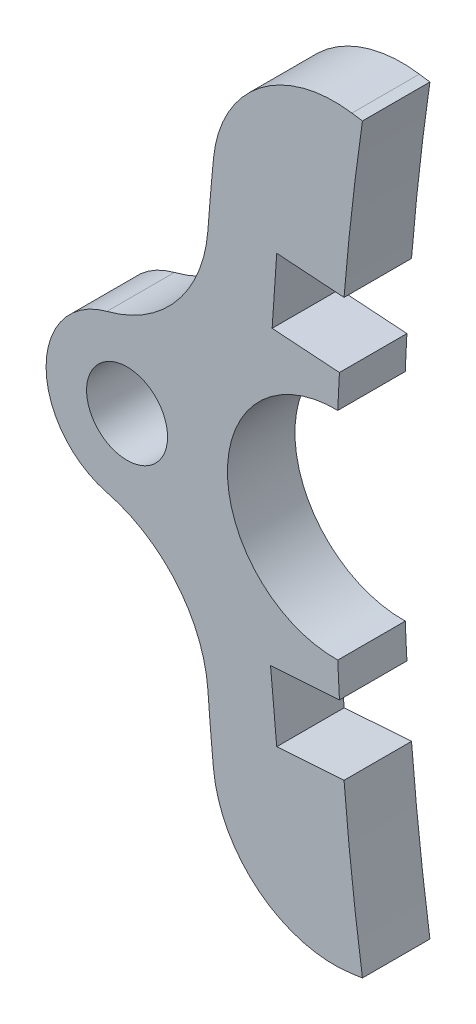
ISO-10303-21;
HEADER;
FILE_DESCRIPTION(('STEP AP214'),'2;1');
FILE_NAME('part.step','',(''),(''),'','','');
FILE_SCHEMA(('AUTOMOTIVE_DESIGN { 1 0 10303 214 1 1 1 1 }'));
ENDSEC;
DATA;
#1=APPLICATION_CONTEXT('core data for automotive mechanical design processes');
#2=APPLICATION_PROTOCOL_DEFINITION('international standard','automotive_design',2000,#1);
#3=PRODUCT_CONTEXT('',#1,'mechanical');
#4=PRODUCT('Part','Part','',(#3));
#5=PRODUCT_RELATED_PRODUCT_CATEGORY('part','',(#4));
#6=PRODUCT_DEFINITION_FORMATION('','',#4);
#7=PRODUCT_DEFINITION_CONTEXT('part definition',#1,'design');
#8=PRODUCT_DEFINITION('design','',#6,#7);
#9=PRODUCT_DEFINITION_SHAPE('','',#8);
#10=(LENGTH_UNIT() NAMED_UNIT(*) SI_UNIT(.MILLI.,.METRE.));
#11=(NAMED_UNIT(*) PLANE_ANGLE_UNIT() SI_UNIT($,.RADIAN.));
#12=(NAMED_UNIT(*) SI_UNIT($,.STERADIAN.) SOLID_ANGLE_UNIT());
#13=UNCERTAINTY_MEASURE_WITH_UNIT(LENGTH_MEASURE(1.E-05),#10,'distance_accuracy_value','');
#14=(GEOMETRIC_REPRESENTATION_CONTEXT(3) GLOBAL_UNCERTAINTY_ASSIGNED_CONTEXT((#13)) GLOBAL_UNIT_ASSIGNED_CONTEXT((#10,
#11,#12)) REPRESENTATION_CONTEXT('',''));
#15=CARTESIAN_POINT('',(0.,0.,0.));
#16=DIRECTION('',(0.,0.,1.));
#17=DIRECTION('',(1.,0.,0.));
#18=AXIS2_PLACEMENT_3D('',#15,#16,#17);
#19=CARTESIAN_POINT('',(-198.495202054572,17.3064352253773,-2.5));
#20=DIRECTION('',(0.,0.,1.));
#21=DIRECTION('',(1.,0.,0.));
#22=AXIS2_PLACEMENT_3D('',#19,#20,#21);
#23=CYLINDRICAL_SURFACE('',#22,8.99999999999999);
#24=DIRECTION('',(0.,0.,1.));
#25=VECTOR('',#24,1.);
#26=CARTESIAN_POINT('',(-207.452243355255,18.184735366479,-2.5));
#27=LINE('',#26,#25);
#28=CARTESIAN_POINT('',(-207.452243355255,18.184735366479,-2.5));
#29=VERTEX_POINT('',#28);
#30=CARTESIAN_POINT('',(-207.452243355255,18.184735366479,2.5));
#31=VERTEX_POINT('',#30);
#32=EDGE_CURVE('E36',#29,#31,#27,.T.);
#33=ORIENTED_EDGE('',*,*,#32,.T.);
#34=CARTESIAN_POINT('',(-198.495202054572,17.3064352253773,2.5));
#35=DIRECTION('',(0.,0.,1.));
#36=DIRECTION('',(1.,0.,0.));
#37=AXIS2_PLACEMENT_3D('',#34,#35,#36);
#38=CIRCLE('',#37,8.99999999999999);
#39=CARTESIAN_POINT('',(-197.197352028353,26.2123650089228,2.5));
#40=VERTEX_POINT('',#39);
#41=EDGE_CURVE('E169',#40,#31,#38,.T.);
#42=ORIENTED_EDGE('',*,*,#41,.F.);
#43=DIRECTION('',(0.,0.,1.));
#44=VECTOR('',#43,1.);
#45=CARTESIAN_POINT('',(-197.197352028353,26.2123650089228,-2.5));
#46=LINE('',#45,#44);
#47=CARTESIAN_POINT('',(-197.197352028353,26.2123650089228,-2.5));
#48=VERTEX_POINT('',#47);
#49=EDGE_CURVE('E11',#48,#40,#46,.T.);
#50=ORIENTED_EDGE('',*,*,#49,.F.);
#51=CARTESIAN_POINT('',(-198.495202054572,17.3064352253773,-2.5));
#52=DIRECTION('',(0.,0.,1.));
#53=DIRECTION('',(1.,0.,0.));
#54=AXIS2_PLACEMENT_3D('',#51,#52,#53);
#55=CIRCLE('',#54,8.99999999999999);
#56=EDGE_CURVE('E170',#48,#29,#55,.T.);
#57=ORIENTED_EDGE('',*,*,#56,.T.);
#58=EDGE_LOOP('',(#33,#42,#50,#57));
#59=FACE_BOUND('',#58,.T.);
#60=ADVANCED_FACE('F33',(#59),#23,.T.);
#61=CARTESIAN_POINT('',(-197.197352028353,26.2123650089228,-2.5));
#62=DIRECTION('',(0.1442055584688,0.989547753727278,0.));
#63=DIRECTION('',(-0.989547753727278,0.1442055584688,0.));
#64=AXIS2_PLACEMENT_3D('',#61,#62,#63);
#65=PLANE('',#64);
#66=ORIENTED_EDGE('',*,*,#49,.T.);
#67=DIRECTION('',(-0.989547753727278,0.1442055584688,0.));
#68=VECTOR('',#67,1.);
#69=CARTESIAN_POINT('',(-197.197352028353,26.2123650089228,2.5));
#70=LINE('',#69,#68);
#71=CARTESIAN_POINT('',(-196.416978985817,26.0986422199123,2.5));
#72=VERTEX_POINT('',#71);
#73=EDGE_CURVE('E188',#72,#40,#70,.T.);
#74=ORIENTED_EDGE('',*,*,#73,.F.);
#75=DIRECTION('',(0.,0.,1.));
#76=VECTOR('',#75,1.);
#77=CARTESIAN_POINT('',(-196.416978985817,26.0986422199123,-2.5));
#78=LINE('',#77,#76);
#79=CARTESIAN_POINT('',(-196.416978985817,26.0986422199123,-2.5));
#80=VERTEX_POINT('',#79);
#81=EDGE_CURVE('E41',#80,#72,#78,.T.);
#82=ORIENTED_EDGE('',*,*,#81,.F.);
#83=DIRECTION('',(-0.989547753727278,0.1442055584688,0.));
#84=VECTOR('',#83,1.);
#85=CARTESIAN_POINT('',(-197.197352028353,26.2123650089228,-2.5));
#86=LINE('',#85,#84);
#87=EDGE_CURVE('E175',#80,#48,#86,.T.);
#88=ORIENTED_EDGE('',*,*,#87,.T.);
#89=EDGE_LOOP('',(#66,#74,#82,#88));
#90=FACE_BOUND('',#89,.T.);
#91=ADVANCED_FACE('F402',(#90),#65,.T.);
#92=CARTESIAN_POINT('',(-7.71022235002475,-1.40135778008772,-2.5));
#93=DIRECTION('',(0.,0.,1.));
#94=DIRECTION('',(1.,0.,0.));
#95=AXIS2_PLACEMENT_3D('',#92,#93,#94);
#96=CYLINDRICAL_SURFACE('',#95,190.7);
#97=ORIENTED_EDGE('',*,*,#81,.T.);
#98=CARTESIAN_POINT('',(-7.71022235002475,-1.40135778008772,2.5));
#99=DIRECTION('',(0.,0.,-1.));
#100=DIRECTION('',(1.,0.,0.));
#101=AXIS2_PLACEMENT_3D('',#98,#99,#100);
#102=CIRCLE('',#101,190.7);
#103=CARTESIAN_POINT('',(-197.779827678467,14.0917093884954,2.5));
#104=VERTEX_POINT('',#103);
#105=EDGE_CURVE('E240',#104,#72,#102,.T.);
#106=ORIENTED_EDGE('',*,*,#105,.F.);
#107=DIRECTION('',(0.,0.,1.));
#108=VECTOR('',#107,1.);
#109=CARTESIAN_POINT('',(-197.779827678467,14.0917093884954,-2.5));
#110=LINE('',#109,#108);
#111=CARTESIAN_POINT('',(-197.779827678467,14.0917093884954,-2.5));
#112=VERTEX_POINT('',#111);
#113=EDGE_CURVE('E301',#112,#104,#110,.T.);
#114=ORIENTED_EDGE('',*,*,#113,.F.);
#115=CARTESIAN_POINT('',(-7.71022235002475,-1.40135778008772,-2.5));
#116=DIRECTION('',(0.,0.,-1.));
#117=DIRECTION('',(1.,0.,0.));
#118=AXIS2_PLACEMENT_3D('',#115,#116,#117);
#119=CIRCLE('',#118,190.7);
#120=EDGE_CURVE('E297',#112,#80,#119,.T.);
#121=ORIENTED_EDGE('',*,*,#120,.T.);
#122=EDGE_LOOP('',(#97,#106,#114,#121));
#123=FACE_BOUND('',#122,.T.);
#124=ADVANCED_FACE('F401',(#123),#96,.F.);
#125=CARTESIAN_POINT('',(-202.768196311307,14.4325588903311,-2.5));
#126=DIRECTION('',(-0.0681699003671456,-0.997673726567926,0.));
#127=DIRECTION('',(0.997673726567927,-0.0681699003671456,0.));
#128=AXIS2_PLACEMENT_3D('',#125,#126,#127);
#129=PLANE('',#128);
#130=ORIENTED_EDGE('',*,*,#113,.T.);
#131=DIRECTION('',(0.997673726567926,-0.0681699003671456,0.));
#132=VECTOR('',#131,1.);
#133=CARTESIAN_POINT('',(-202.768196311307,14.4325588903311,2.5));
#134=LINE('',#133,#132);
#135=CARTESIAN_POINT('',(-202.768196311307,14.4325588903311,2.5));
#136=VERTEX_POINT('',#135);
#137=EDGE_CURVE('E237',#136,#104,#134,.T.);
#138=ORIENTED_EDGE('',*,*,#137,.F.);
#139=DIRECTION('',(0.,0.,1.));
#140=VECTOR('',#139,1.);
#141=CARTESIAN_POINT('',(-202.768196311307,14.4325588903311,-2.5));
#142=LINE('',#141,#140);
#143=CARTESIAN_POINT('',(-202.768196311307,14.4325588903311,-2.5));
#144=VERTEX_POINT('',#143);
#145=EDGE_CURVE('E303',#144,#136,#142,.T.);
#146=ORIENTED_EDGE('',*,*,#145,.F.);
#147=DIRECTION('',(0.997673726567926,-0.0681699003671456,0.));
#148=VECTOR('',#147,1.);
#149=CARTESIAN_POINT('',(-202.768196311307,14.4325588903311,-2.5));
#150=LINE('',#149,#148);
#151=EDGE_CURVE('E294',#144,#112,#150,.T.);
#152=ORIENTED_EDGE('',*,*,#151,.T.);
#153=EDGE_LOOP('',(#130,#138,#146,#152));
#154=FACE_BOUND('',#153,.T.);
#155=ADVANCED_FACE('F397',(#154),#129,.T.);
#156=CARTESIAN_POINT('',(-202.768196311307,14.4325588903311,-2.5));
#157=DIRECTION('',(0.997673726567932,-0.0681699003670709,0.));
#158=DIRECTION('',(0.0681699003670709,0.997673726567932,0.));
#159=AXIS2_PLACEMENT_3D('',#156,#157,#158);
#160=PLANE('',#159);
#161=ORIENTED_EDGE('',*,*,#145,.T.);
#162=DIRECTION('',(0.0681699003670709,0.997673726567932,0.));
#163=VECTOR('',#162,1.);
#164=CARTESIAN_POINT('',(-202.768196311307,14.4325588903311,2.5));
#165=LINE('',#164,#163);
#166=CARTESIAN_POINT('',(-203.109045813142,9.44419025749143,2.5));
#167=VERTEX_POINT('',#166);
#168=EDGE_CURVE('E234',#167,#136,#165,.T.);
#169=ORIENTED_EDGE('',*,*,#168,.F.);
#170=DIRECTION('',(0.,0.,1.));
#171=VECTOR('',#170,1.);
#172=CARTESIAN_POINT('',(-203.109045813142,9.44419025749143,-2.5));
#173=LINE('',#172,#171);
#174=CARTESIAN_POINT('',(-203.109045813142,9.44419025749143,-2.5));
#175=VERTEX_POINT('',#174);
#176=EDGE_CURVE('E305',#175,#167,#173,.T.);
#177=ORIENTED_EDGE('',*,*,#176,.F.);
#178=DIRECTION('',(0.0681699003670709,0.997673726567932,0.));
#179=VECTOR('',#178,1.);
#180=CARTESIAN_POINT('',(-202.768196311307,14.4325588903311,-2.5));
#181=LINE('',#180,#179);
#182=EDGE_CURVE('E291',#175,#144,#181,.T.);
#183=ORIENTED_EDGE('',*,*,#182,.T.);
#184=EDGE_LOOP('',(#161,#169,#177,#183));
#185=FACE_BOUND('',#184,.T.);
#186=ADVANCED_FACE('F392',(#185),#160,.T.);
#187=CARTESIAN_POINT('',(-203.109045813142,9.44419025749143,-2.5));
#188=DIRECTION('',(0.0681699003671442,0.997673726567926,0.));
#189=DIRECTION('',(-0.997673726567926,0.0681699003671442,0.));
#190=AXIS2_PLACEMENT_3D('',#187,#188,#189);
#191=PLANE('',#190);
#192=ORIENTED_EDGE('',*,*,#176,.T.);
#193=DIRECTION('',(-0.997673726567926,0.0681699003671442,0.));
#194=VECTOR('',#193,1.);
#195=CARTESIAN_POINT('',(-203.109045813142,9.44419025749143,2.5));
#196=LINE('',#195,#194);
#197=CARTESIAN_POINT('',(-198.120677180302,9.10334075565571,2.5));
#198=VERTEX_POINT('',#197);
#199=EDGE_CURVE('E231',#198,#167,#196,.T.);
#200=ORIENTED_EDGE('',*,*,#199,.F.);
#201=DIRECTION('',(0.,0.,1.));
#202=VECTOR('',#201,1.);
#203=CARTESIAN_POINT('',(-198.120677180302,9.10334075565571,-2.5));
#204=LINE('',#203,#202);
#205=CARTESIAN_POINT('',(-198.120677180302,9.10334075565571,-2.5));
#206=VERTEX_POINT('',#205);
#207=EDGE_CURVE('E307',#206,#198,#204,.T.);
#208=ORIENTED_EDGE('',*,*,#207,.F.);
#209=DIRECTION('',(-0.997673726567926,0.0681699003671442,0.));
#210=VECTOR('',#209,1.);
#211=CARTESIAN_POINT('',(-203.109045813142,9.44419025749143,-2.5));
#212=LINE('',#211,#210);
#213=EDGE_CURVE('E288',#206,#175,#212,.T.);
#214=ORIENTED_EDGE('',*,*,#213,.T.);
#215=EDGE_LOOP('',(#192,#200,#208,#214));
#216=FACE_BOUND('',#215,.T.);
#217=ADVANCED_FACE('F390',(#216),#191,.T.);
#218=CARTESIAN_POINT('',(-7.71022235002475,-1.40135778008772,-2.5));
#219=DIRECTION('',(0.,0.,1.));
#220=DIRECTION('',(1.,0.,0.));
#221=AXIS2_PLACEMENT_3D('',#218,#219,#220);
#222=CYLINDRICAL_SURFACE('',#221,190.7);
#223=ORIENTED_EDGE('',*,*,#207,.T.);
#224=CARTESIAN_POINT('',(-7.71022235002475,-1.40135778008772,2.5));
#225=DIRECTION('',(0.,0.,-1.));
#226=DIRECTION('',(1.,0.,0.));
#227=AXIS2_PLACEMENT_3D('',#224,#225,#226);
#228=CIRCLE('',#227,190.7);
#229=CARTESIAN_POINT('',(-198.242026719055,6.60623386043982,2.5));
#230=VERTEX_POINT('',#229);
#231=EDGE_CURVE('E228',#230,#198,#228,.T.);
#232=ORIENTED_EDGE('',*,*,#231,.F.);
#233=DIRECTION('',(0.,0.,1.));
#234=VECTOR('',#233,1.);
#235=CARTESIAN_POINT('',(-198.242026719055,6.60623386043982,-2.5));
#236=LINE('',#235,#234);
#237=CARTESIAN_POINT('',(-198.242026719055,6.60623386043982,-2.5));
#238=VERTEX_POINT('',#237);
#239=EDGE_CURVE('E309',#238,#230,#236,.T.);
#240=ORIENTED_EDGE('',*,*,#239,.F.);
#241=CARTESIAN_POINT('',(-7.71022235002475,-1.40135778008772,-2.5));
#242=DIRECTION('',(0.,0.,-1.));
#243=DIRECTION('',(1.,0.,0.));
#244=AXIS2_PLACEMENT_3D('',#241,#242,#243);
#245=CIRCLE('',#244,190.7);
#246=EDGE_CURVE('E285',#238,#206,#245,.T.);
#247=ORIENTED_EDGE('',*,*,#246,.T.);
#248=EDGE_LOOP('',(#223,#232,#240,#247));
#249=FACE_BOUND('',#248,.T.);
#250=ADVANCED_FACE('F385',(#249),#222,.F.);
#251=CARTESIAN_POINT('',(-198.410222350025,-1.40135778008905,-2.5));
#252=DIRECTION('',(0.,0.,1.));
#253=DIRECTION('',(1.,0.,0.));
#254=AXIS2_PLACEMENT_3D('',#251,#252,#253);
#255=CYLINDRICAL_SURFACE('',#254,8.00935788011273);
#256=ORIENTED_EDGE('',*,*,#239,.T.);
#257=CARTESIAN_POINT('',(-198.410222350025,-1.40135778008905,2.5));
#258=DIRECTION('',(0.,0.,-1.));
#259=DIRECTION('',(1.,0.,0.));
#260=AXIS2_PLACEMENT_3D('',#257,#258,#259);
#261=CIRCLE('',#260,8.00935788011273);
#262=CARTESIAN_POINT('',(-198.242026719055,-9.40894942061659,2.5));
#263=VERTEX_POINT('',#262);
#264=EDGE_CURVE('E225',#263,#230,#261,.T.);
#265=ORIENTED_EDGE('',*,*,#264,.F.);
#266=DIRECTION('',(0.,0.,1.));
#267=VECTOR('',#266,1.);
#268=CARTESIAN_POINT('',(-198.242026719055,-9.40894942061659,-2.5));
#269=LINE('',#268,#267);
#270=CARTESIAN_POINT('',(-198.242026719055,-9.40894942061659,-2.5));
#271=VERTEX_POINT('',#270);
#272=EDGE_CURVE('E311',#271,#263,#269,.T.);
#273=ORIENTED_EDGE('',*,*,#272,.F.);
#274=CARTESIAN_POINT('',(-198.410222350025,-1.40135778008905,-2.5));
#275=DIRECTION('',(0.,0.,-1.));
#276=DIRECTION('',(1.,0.,0.));
#277=AXIS2_PLACEMENT_3D('',#274,#275,#276);
#278=CIRCLE('',#277,8.00935788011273);
#279=EDGE_CURVE('E282',#271,#238,#278,.T.);
#280=ORIENTED_EDGE('',*,*,#279,.T.);
#281=EDGE_LOOP('',(#256,#265,#273,#280));
#282=FACE_BOUND('',#281,.T.);
#283=ADVANCED_FACE('F380',(#282),#255,.F.);
#284=CARTESIAN_POINT('',(-7.71022235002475,-1.40135778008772,-2.5));
#285=DIRECTION('',(0.,0.,1.));
#286=DIRECTION('',(1.,0.,0.));
#287=AXIS2_PLACEMENT_3D('',#284,#285,#286);
#288=CYLINDRICAL_SURFACE('',#287,190.7);
#289=ORIENTED_EDGE('',*,*,#272,.T.);
#290=CARTESIAN_POINT('',(-7.71022235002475,-1.40135778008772,2.5));
#291=DIRECTION('',(0.,0.,-1.));
#292=DIRECTION('',(1.,0.,0.));
#293=AXIS2_PLACEMENT_3D('',#290,#291,#292);
#294=CIRCLE('',#293,190.7);
#295=CARTESIAN_POINT('',(-198.120677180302,-11.9060563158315,2.5));
#296=VERTEX_POINT('',#295);
#297=EDGE_CURVE('E222',#296,#263,#294,.T.);
#298=ORIENTED_EDGE('',*,*,#297,.F.);
#299=DIRECTION('',(0.,0.,1.));
#300=VECTOR('',#299,1.);
#301=CARTESIAN_POINT('',(-198.120677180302,-11.9060563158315,-2.5));
#302=LINE('',#301,#300);
#303=CARTESIAN_POINT('',(-198.120677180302,-11.9060563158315,-2.5));
#304=VERTEX_POINT('',#303);
#305=EDGE_CURVE('E313',#304,#296,#302,.T.);
#306=ORIENTED_EDGE('',*,*,#305,.F.);
#307=CARTESIAN_POINT('',(-7.71022235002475,-1.40135778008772,-2.5));
#308=DIRECTION('',(0.,0.,-1.));
#309=DIRECTION('',(1.,0.,0.));
#310=AXIS2_PLACEMENT_3D('',#307,#308,#309);
#311=CIRCLE('',#310,190.7);
#312=EDGE_CURVE('E279',#304,#271,#311,.T.);
#313=ORIENTED_EDGE('',*,*,#312,.T.);
#314=EDGE_LOOP('',(#289,#298,#306,#313));
#315=FACE_BOUND('',#314,.T.);
#316=ADVANCED_FACE('F378',(#315),#288,.F.);
#317=CARTESIAN_POINT('',(-203.226724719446,-12.2549466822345,-2.5));
#318=DIRECTION('',(0.0681699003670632,-0.997673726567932,0.));
#319=DIRECTION('',(0.997673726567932,0.0681699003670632,0.));
#320=AXIS2_PLACEMENT_3D('',#317,#318,#319);
#321=PLANE('',#320);
#322=ORIENTED_EDGE('',*,*,#305,.T.);
#323=DIRECTION('',(0.997673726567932,0.0681699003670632,0.));
#324=VECTOR('',#323,1.);
#325=CARTESIAN_POINT('',(-203.226724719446,-12.2549466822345,2.5));
#326=LINE('',#325,#324);
#327=CARTESIAN_POINT('',(-203.226724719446,-12.2549466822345,2.5));
#328=VERTEX_POINT('',#327);
#329=EDGE_CURVE('E219',#328,#296,#326,.T.);
#330=ORIENTED_EDGE('',*,*,#329,.F.);
#331=DIRECTION('',(0.,0.,1.));
#332=VECTOR('',#331,1.);
#333=CARTESIAN_POINT('',(-203.226724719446,-12.2549466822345,-2.5));
#334=LINE('',#333,#332);
#335=CARTESIAN_POINT('',(-203.226724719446,-12.2549466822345,-2.5));
#336=VERTEX_POINT('',#335);
#337=EDGE_CURVE('E315',#336,#328,#334,.T.);
#338=ORIENTED_EDGE('',*,*,#337,.F.);
#339=DIRECTION('',(0.997673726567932,0.0681699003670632,0.));
#340=VECTOR('',#339,1.);
#341=CARTESIAN_POINT('',(-203.226724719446,-12.2549466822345,-2.5));
#342=LINE('',#341,#340);
#343=EDGE_CURVE('E276',#336,#304,#342,.T.);
#344=ORIENTED_EDGE('',*,*,#343,.T.);
#345=EDGE_LOOP('',(#322,#330,#338,#344));
#346=FACE_BOUND('',#345,.T.);
#347=ADVANCED_FACE('F373',(#346),#321,.T.);
#348=CARTESIAN_POINT('',(-203.226724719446,-12.2549466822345,-2.5));
#349=DIRECTION('',(0.995788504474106,0.0916801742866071,0.));
#350=DIRECTION('',(-0.0916801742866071,0.995788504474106,0.));
#351=AXIS2_PLACEMENT_3D('',#348,#349,#350);
#352=PLANE('',#351);
#353=ORIENTED_EDGE('',*,*,#337,.T.);
#354=DIRECTION('',(-0.0916801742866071,0.995788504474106,0.));
#355=VECTOR('',#354,1.);
#356=CARTESIAN_POINT('',(-203.226724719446,-12.2549466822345,2.5));
#357=LINE('',#356,#355);
#358=CARTESIAN_POINT('',(-202.768196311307,-17.2352744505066,2.5));
#359=VERTEX_POINT('',#358);
#360=EDGE_CURVE('E216',#359,#328,#357,.T.);
#361=ORIENTED_EDGE('',*,*,#360,.F.);
#362=DIRECTION('',(0.,0.,1.));
#363=VECTOR('',#362,1.);
#364=CARTESIAN_POINT('',(-202.768196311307,-17.2352744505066,-2.5));
#365=LINE('',#364,#363);
#366=CARTESIAN_POINT('',(-202.768196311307,-17.2352744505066,-2.5));
#367=VERTEX_POINT('',#366);
#368=EDGE_CURVE('E317',#367,#359,#365,.T.);
#369=ORIENTED_EDGE('',*,*,#368,.F.);
#370=DIRECTION('',(-0.0916801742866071,0.995788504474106,0.));
#371=VECTOR('',#370,1.);
#372=CARTESIAN_POINT('',(-203.226724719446,-12.2549466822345,-2.5));
#373=LINE('',#372,#371);
#374=EDGE_CURVE('E273',#367,#336,#373,.T.);
#375=ORIENTED_EDGE('',*,*,#374,.T.);
#376=EDGE_LOOP('',(#353,#361,#369,#375));
#377=FACE_BOUND('',#376,.T.);
#378=ADVANCED_FACE('F368',(#377),#352,.T.);
#379=CARTESIAN_POINT('',(-202.768196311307,-17.2352744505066,-2.5));
#380=DIRECTION('',(-0.0681699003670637,0.997673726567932,0.));
#381=DIRECTION('',(-0.997673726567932,-0.0681699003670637,0.));
#382=AXIS2_PLACEMENT_3D('',#379,#380,#381);
#383=PLANE('',#382);
#384=ORIENTED_EDGE('',*,*,#368,.T.);
#385=DIRECTION('',(-0.997673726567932,-0.0681699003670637,0.));
#386=VECTOR('',#385,1.);
#387=CARTESIAN_POINT('',(-202.768196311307,-17.2352744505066,2.5));
#388=LINE('',#387,#386);
#389=CARTESIAN_POINT('',(-197.779827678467,-16.8944249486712,2.5));
#390=VERTEX_POINT('',#389);
#391=EDGE_CURVE('E213',#390,#359,#388,.T.);
#392=ORIENTED_EDGE('',*,*,#391,.F.);
#393=DIRECTION('',(0.,0.,1.));
#394=VECTOR('',#393,1.);
#395=CARTESIAN_POINT('',(-197.779827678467,-16.8944249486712,-2.5));
#396=LINE('',#395,#394);
#397=CARTESIAN_POINT('',(-197.779827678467,-16.8944249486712,-2.5));
#398=VERTEX_POINT('',#397);
#399=EDGE_CURVE('E319',#398,#390,#396,.T.);
#400=ORIENTED_EDGE('',*,*,#399,.F.);
#401=DIRECTION('',(-0.997673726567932,-0.0681699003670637,0.));
#402=VECTOR('',#401,1.);
#403=CARTESIAN_POINT('',(-202.768196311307,-17.2352744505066,-2.5));
#404=LINE('',#403,#402);
#405=EDGE_CURVE('E270',#398,#367,#404,.T.);
#406=ORIENTED_EDGE('',*,*,#405,.T.);
#407=EDGE_LOOP('',(#384,#392,#400,#406));
#408=FACE_BOUND('',#407,.T.);
#409=ADVANCED_FACE('F366',(#408),#383,.T.);
#410=CARTESIAN_POINT('',(-7.71022235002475,-1.40135778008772,-2.5));
#411=DIRECTION('',(0.,0.,1.));
#412=DIRECTION('',(1.,0.,0.));
#413=AXIS2_PLACEMENT_3D('',#410,#411,#412);
#414=CYLINDRICAL_SURFACE('',#413,190.7);
#415=ORIENTED_EDGE('',*,*,#399,.T.);
#416=CARTESIAN_POINT('',(-7.71022235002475,-1.40135778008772,2.5));
#417=DIRECTION('',(0.,0.,-1.));
#418=DIRECTION('',(1.,0.,0.));
#419=AXIS2_PLACEMENT_3D('',#416,#417,#418);
#420=CIRCLE('',#419,190.7);
#421=CARTESIAN_POINT('',(-196.416978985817,-28.9013577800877,2.5));
#422=VERTEX_POINT('',#421);
#423=EDGE_CURVE('E210',#422,#390,#420,.T.);
#424=ORIENTED_EDGE('',*,*,#423,.F.);
#425=DIRECTION('',(0.,0.,1.));
#426=VECTOR('',#425,1.);
#427=CARTESIAN_POINT('',(-196.416978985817,-28.9013577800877,-2.5));
#428=LINE('',#427,#426);
#429=CARTESIAN_POINT('',(-196.416978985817,-28.9013577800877,-2.5));
#430=VERTEX_POINT('',#429);
#431=EDGE_CURVE('E321',#430,#422,#428,.T.);
#432=ORIENTED_EDGE('',*,*,#431,.F.);
#433=CARTESIAN_POINT('',(-7.71022235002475,-1.40135778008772,-2.5));
#434=DIRECTION('',(0.,0.,-1.));
#435=DIRECTION('',(1.,0.,0.));
#436=AXIS2_PLACEMENT_3D('',#433,#434,#435);
#437=CIRCLE('',#436,190.7);
#438=EDGE_CURVE('E267',#430,#398,#437,.T.);
#439=ORIENTED_EDGE('',*,*,#438,.T.);
#440=EDGE_LOOP('',(#415,#424,#432,#439));
#441=FACE_BOUND('',#440,.T.);
#442=ADVANCED_FACE('F361',(#441),#414,.F.);
#443=CARTESIAN_POINT('',(-197.197352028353,-29.0150805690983,-2.5));
#444=DIRECTION('',(0.1442055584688,-0.989547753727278,0.));
#445=DIRECTION('',(0.989547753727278,0.1442055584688,0.));
#446=AXIS2_PLACEMENT_3D('',#443,#444,#445);
#447=PLANE('',#446);
#448=ORIENTED_EDGE('',*,*,#431,.T.);
#449=DIRECTION('',(0.989547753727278,0.1442055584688,0.));
#450=VECTOR('',#449,1.);
#451=CARTESIAN_POINT('',(-197.197352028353,-29.0150805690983,2.5));
#452=LINE('',#451,#450);
#453=CARTESIAN_POINT('',(-197.197352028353,-29.0150805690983,2.5));
#454=VERTEX_POINT('',#453);
#455=EDGE_CURVE('E207',#454,#422,#452,.T.);
#456=ORIENTED_EDGE('',*,*,#455,.F.);
#457=DIRECTION('',(0.,0.,1.));
#458=VECTOR('',#457,1.);
#459=CARTESIAN_POINT('',(-197.197352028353,-29.0150805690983,-2.5));
#460=LINE('',#459,#458);
#461=CARTESIAN_POINT('',(-197.197352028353,-29.0150805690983,-2.5));
#462=VERTEX_POINT('',#461);
#463=EDGE_CURVE('E323',#462,#454,#460,.T.);
#464=ORIENTED_EDGE('',*,*,#463,.F.);
#465=DIRECTION('',(0.989547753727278,0.1442055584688,0.));
#466=VECTOR('',#465,1.);
#467=CARTESIAN_POINT('',(-197.197352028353,-29.0150805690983,-2.5));
#468=LINE('',#467,#466);
#469=EDGE_CURVE('E264',#462,#430,#468,.T.);
#470=ORIENTED_EDGE('',*,*,#469,.T.);
#471=EDGE_LOOP('',(#448,#456,#464,#470));
#472=FACE_BOUND('',#471,.T.);
#473=ADVANCED_FACE('F356',(#472),#447,.T.);
#474=CARTESIAN_POINT('',(-198.495202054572,-20.1091507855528,-2.5));
#475=DIRECTION('',(0.,0.,1.));
#476=DIRECTION('',(1.,0.,0.));
#477=AXIS2_PLACEMENT_3D('',#474,#475,#476);
#478=CYLINDRICAL_SURFACE('',#477,8.99999999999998);
#479=ORIENTED_EDGE('',*,*,#463,.T.);
#480=CARTESIAN_POINT('',(-198.495202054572,-20.1091507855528,2.5));
#481=DIRECTION('',(0.,0.,1.));
#482=DIRECTION('',(-1.,0.,0.));
#483=AXIS2_PLACEMENT_3D('',#480,#481,#482);
#484=CIRCLE('',#483,8.99999999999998);
#485=CARTESIAN_POINT('',(-207.452243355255,-20.9874509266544,2.5));
#486=VERTEX_POINT('',#485);
#487=EDGE_CURVE('E204',#486,#454,#484,.T.);
#488=ORIENTED_EDGE('',*,*,#487,.F.);
#489=DIRECTION('',(0.,0.,1.));
#490=VECTOR('',#489,1.);
#491=CARTESIAN_POINT('',(-207.452243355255,-20.9874509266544,-2.5));
#492=LINE('',#491,#490);
#493=CARTESIAN_POINT('',(-207.452243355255,-20.9874509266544,-2.5));
#494=VERTEX_POINT('',#493);
#495=EDGE_CURVE('E325',#494,#486,#492,.T.);
#496=ORIENTED_EDGE('',*,*,#495,.F.);
#497=CARTESIAN_POINT('',(-198.495202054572,-20.1091507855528,-2.5));
#498=DIRECTION('',(0.,0.,1.));
#499=DIRECTION('',(-1.,0.,0.));
#500=AXIS2_PLACEMENT_3D('',#497,#498,#499);
#501=CIRCLE('',#500,8.99999999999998);
#502=EDGE_CURVE('E261',#494,#462,#501,.T.);
#503=ORIENTED_EDGE('',*,*,#502,.T.);
#504=EDGE_LOOP('',(#479,#488,#496,#503));
#505=FACE_BOUND('',#504,.T.);
#506=ADVANCED_FACE('F354',(#505),#478,.T.);
#507=CARTESIAN_POINT('',(-7.71022235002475,-1.40135778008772,-2.5));
#508=DIRECTION('',(0.,0.,1.));
#509=DIRECTION('',(1.,0.,0.));
#510=AXIS2_PLACEMENT_3D('',#507,#508,#509);
#511=CYLINDRICAL_SURFACE('',#510,200.7);
#512=ORIENTED_EDGE('',*,*,#495,.T.);
#513=CARTESIAN_POINT('',(-7.71022235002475,-1.40135778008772,2.5));
#514=DIRECTION('',(0.,0.,1.));
#515=DIRECTION('',(1.,0.,0.));
#516=AXIS2_PLACEMENT_3D('',#513,#514,#515);
#517=CIRCLE('',#516,200.7);
#518=CARTESIAN_POINT('',(-207.866643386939,-16.1626963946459,2.5));
#519=VERTEX_POINT('',#518);
#520=EDGE_CURVE('E201',#519,#486,#517,.T.);
#521=ORIENTED_EDGE('',*,*,#520,.F.);
#522=DIRECTION('',(0.,0.,1.));
#523=VECTOR('',#522,1.);
#524=CARTESIAN_POINT('',(-207.866643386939,-16.1626963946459,-2.5));
#525=LINE('',#524,#523);
#526=CARTESIAN_POINT('',(-207.866643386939,-16.1626963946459,-2.5));
#527=VERTEX_POINT('',#526);
#528=EDGE_CURVE('E327',#527,#519,#525,.T.);
#529=ORIENTED_EDGE('',*,*,#528,.F.);
#530=CARTESIAN_POINT('',(-7.71022235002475,-1.40135778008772,-2.5));
#531=DIRECTION('',(0.,0.,1.));
#532=DIRECTION('',(1.,0.,0.));
#533=AXIS2_PLACEMENT_3D('',#530,#531,#532);
#534=CIRCLE('',#533,200.7);
#535=EDGE_CURVE('E258',#527,#494,#534,.T.);
#536=ORIENTED_EDGE('',*,*,#535,.T.);
#537=EDGE_LOOP('',(#512,#521,#529,#536));
#538=FACE_BOUND('',#537,.T.);
#539=ADVANCED_FACE('F349',(#538),#511,.T.);
#540=CARTESIAN_POINT('',(-217.839559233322,-16.8981891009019,-2.5));
#541=DIRECTION('',(0.,0.,1.));
#542=DIRECTION('',(1.,0.,0.));
#543=AXIS2_PLACEMENT_3D('',#540,#541,#542);
#544=CYLINDRICAL_SURFACE('',#543,10.);
#545=ORIENTED_EDGE('',*,*,#528,.T.);
#546=CARTESIAN_POINT('',(-217.839559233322,-16.8981891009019,2.5));
#547=DIRECTION('',(0.,0.,-1.));
#548=DIRECTION('',(-1.,0.,0.));
#549=AXIS2_PLACEMENT_3D('',#546,#547,#548);
#550=CIRCLE('',#549,10.);
#551=CARTESIAN_POINT('',(-215.351445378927,-7.21266952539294,2.5));
#552=VERTEX_POINT('',#551);
#553=EDGE_CURVE('E198',#552,#519,#550,.T.);
#554=ORIENTED_EDGE('',*,*,#553,.F.);
#555=DIRECTION('',(0.,0.,1.));
#556=VECTOR('',#555,1.);
#557=CARTESIAN_POINT('',(-215.351445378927,-7.21266952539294,-2.5));
#558=LINE('',#557,#556);
#559=CARTESIAN_POINT('',(-215.351445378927,-7.21266952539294,-2.5));
#560=VERTEX_POINT('',#559);
#561=EDGE_CURVE('E329',#560,#552,#558,.T.);
#562=ORIENTED_EDGE('',*,*,#561,.F.);
#563=CARTESIAN_POINT('',(-217.839559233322,-16.8981891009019,-2.5));
#564=DIRECTION('',(0.,0.,-1.));
#565=DIRECTION('',(-1.,0.,0.));
#566=AXIS2_PLACEMENT_3D('',#563,#564,#565);
#567=CIRCLE('',#566,10.);
#568=EDGE_CURVE('E255',#560,#527,#567,.T.);
#569=ORIENTED_EDGE('',*,*,#568,.T.);
#570=EDGE_LOOP('',(#545,#554,#562,#569));
#571=FACE_BOUND('',#570,.T.);
#572=ADVANCED_FACE('F342',(#571),#544,.F.);
#573=CARTESIAN_POINT('',(-213.85857706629,-1.40135778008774,-2.5));
#574=DIRECTION('',(0.,0.,1.));
#575=DIRECTION('',(1.,0.,0.));
#576=AXIS2_PLACEMENT_3D('',#573,#574,#575);
#577=CYLINDRICAL_SURFACE('',#576,5.99999999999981);
#578=ORIENTED_EDGE('',*,*,#561,.T.);
#579=CARTESIAN_POINT('',(-213.85857706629,-1.40135778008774,2.5));
#580=DIRECTION('',(0.,0.,1.));
#581=DIRECTION('',(1.,0.,0.));
#582=AXIS2_PLACEMENT_3D('',#579,#580,#581);
#583=CIRCLE('',#582,5.99999999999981);
#584=CARTESIAN_POINT('',(-215.351445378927,4.40995396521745,2.5));
#585=VERTEX_POINT('',#584);
#586=EDGE_CURVE('E195',#585,#552,#583,.T.);
#587=ORIENTED_EDGE('',*,*,#586,.F.);
#588=DIRECTION('',(0.,0.,1.));
#589=VECTOR('',#588,1.);
#590=CARTESIAN_POINT('',(-215.351445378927,4.40995396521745,-2.5));
#591=LINE('',#590,#589);
#592=CARTESIAN_POINT('',(-215.351445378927,4.40995396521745,-2.5));
#593=VERTEX_POINT('',#592);
#594=EDGE_CURVE('E331',#593,#585,#591,.T.);
#595=ORIENTED_EDGE('',*,*,#594,.F.);
#596=CARTESIAN_POINT('',(-213.85857706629,-1.40135778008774,-2.5));
#597=DIRECTION('',(0.,0.,1.));
#598=DIRECTION('',(1.,0.,0.));
#599=AXIS2_PLACEMENT_3D('',#596,#597,#598);
#600=CIRCLE('',#599,5.99999999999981);
#601=EDGE_CURVE('E252',#593,#560,#600,.T.);
#602=ORIENTED_EDGE('',*,*,#601,.T.);
#603=EDGE_LOOP('',(#578,#587,#595,#602));
#604=FACE_BOUND('',#603,.T.);
#605=ADVANCED_FACE('F339',(#604),#577,.T.);
#606=CARTESIAN_POINT('',(-217.839559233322,14.0954735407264,-2.5));
#607=DIRECTION('',(0.,0.,1.));
#608=DIRECTION('',(1.,0.,0.));
#609=AXIS2_PLACEMENT_3D('',#606,#607,#608);
#610=CYLINDRICAL_SURFACE('',#609,10.);
#611=ORIENTED_EDGE('',*,*,#594,.T.);
#612=CARTESIAN_POINT('',(-217.839559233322,14.0954735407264,2.5));
#613=DIRECTION('',(0.,0.,-1.));
#614=DIRECTION('',(1.,0.,0.));
#615=AXIS2_PLACEMENT_3D('',#612,#613,#614);
#616=CIRCLE('',#615,10.);
#617=CARTESIAN_POINT('',(-207.866643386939,13.3599808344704,2.5));
#618=VERTEX_POINT('',#617);
#619=EDGE_CURVE('E182',#618,#585,#616,.T.);
#620=ORIENTED_EDGE('',*,*,#619,.F.);
#621=DIRECTION('',(0.,0.,1.));
#622=VECTOR('',#621,1.);
#623=CARTESIAN_POINT('',(-207.866643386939,13.3599808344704,-2.5));
#624=LINE('',#623,#622);
#625=CARTESIAN_POINT('',(-207.866643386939,13.3599808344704,-2.5));
#626=VERTEX_POINT('',#625);
#627=EDGE_CURVE('E174',#626,#618,#624,.T.);
#628=ORIENTED_EDGE('',*,*,#627,.F.);
#629=CARTESIAN_POINT('',(-217.839559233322,14.0954735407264,-2.5));
#630=DIRECTION('',(0.,0.,-1.));
#631=DIRECTION('',(1.,0.,0.));
#632=AXIS2_PLACEMENT_3D('',#629,#630,#631);
#633=CIRCLE('',#632,10.);
#634=EDGE_CURVE('E249',#626,#593,#633,.T.);
#635=ORIENTED_EDGE('',*,*,#634,.T.);
#636=EDGE_LOOP('',(#611,#620,#628,#635));
#637=FACE_BOUND('',#636,.T.);
#638=ADVANCED_FACE('F333',(#637),#610,.F.);
#639=CARTESIAN_POINT('',(-7.71022235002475,-1.40135778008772,-2.5));
#640=DIRECTION('',(0.,0.,1.));
#641=DIRECTION('',(1.,0.,0.));
#642=AXIS2_PLACEMENT_3D('',#639,#640,#641);
#643=CYLINDRICAL_SURFACE('',#642,200.7);
#644=ORIENTED_EDGE('',*,*,#627,.T.);
#645=CARTESIAN_POINT('',(-7.71022235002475,-1.40135778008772,2.5));
#646=DIRECTION('',(0.,0.,1.));
#647=DIRECTION('',(1.,0.,0.));
#648=AXIS2_PLACEMENT_3D('',#645,#646,#647);
#649=CIRCLE('',#648,200.7);
#650=EDGE_CURVE('E177',#31,#618,#649,.T.);
#651=ORIENTED_EDGE('',*,*,#650,.F.);
#652=ORIENTED_EDGE('',*,*,#32,.F.);
#653=CARTESIAN_POINT('',(-7.71022235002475,-1.40135778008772,-2.5));
#654=DIRECTION('',(0.,0.,1.));
#655=DIRECTION('',(1.,0.,0.));
#656=AXIS2_PLACEMENT_3D('',#653,#654,#655);
#657=CIRCLE('',#656,200.7);
#658=EDGE_CURVE('E247',#29,#626,#657,.T.);
#659=ORIENTED_EDGE('',*,*,#658,.T.);
#660=EDGE_LOOP('',(#644,#651,#652,#659));
#661=FACE_BOUND('',#660,.T.);
#662=ADVANCED_FACE('F178',(#661),#643,.T.);
#663=CARTESIAN_POINT('',(-198.495202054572,17.3064352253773,-2.5));
#664=DIRECTION('',(0.,0.,1.));
#665=DIRECTION('',(1.,0.,0.));
#666=AXIS2_PLACEMENT_3D('',#663,#664,#665);
#667=PLANE('',#666);
#668=CARTESIAN_POINT('',(-213.85857706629,-1.40135778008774,-2.5));
#669=DIRECTION('',(0.,0.,1.));
#670=DIRECTION('',(1.,0.,0.));
#671=AXIS2_PLACEMENT_3D('',#668,#669,#670);
#672=CIRCLE('',#671,2.99999999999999);
#673=CARTESIAN_POINT('',(-210.85857706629,-1.40135778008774,-2.5));
#674=VERTEX_POINT('',#673);
#675=EDGE_CURVE('E243',#674,#674,#672,.T.);
#676=ORIENTED_EDGE('',*,*,#675,.T.);
#677=EDGE_LOOP('',(#676));
#678=FACE_BOUND('',#677,.T.);
#679=ORIENTED_EDGE('',*,*,#56,.F.);
#680=ORIENTED_EDGE('',*,*,#87,.F.);
#681=ORIENTED_EDGE('',*,*,#120,.F.);
#682=ORIENTED_EDGE('',*,*,#151,.F.);
#683=ORIENTED_EDGE('',*,*,#182,.F.);
#684=ORIENTED_EDGE('',*,*,#213,.F.);
#685=ORIENTED_EDGE('',*,*,#246,.F.);
#686=ORIENTED_EDGE('',*,*,#279,.F.);
#687=ORIENTED_EDGE('',*,*,#312,.F.);
#688=ORIENTED_EDGE('',*,*,#343,.F.);
#689=ORIENTED_EDGE('',*,*,#374,.F.);
#690=ORIENTED_EDGE('',*,*,#405,.F.);
#691=ORIENTED_EDGE('',*,*,#438,.F.);
#692=ORIENTED_EDGE('',*,*,#469,.F.);
#693=ORIENTED_EDGE('',*,*,#502,.F.);
#694=ORIENTED_EDGE('',*,*,#535,.F.);
#695=ORIENTED_EDGE('',*,*,#568,.F.);
#696=ORIENTED_EDGE('',*,*,#601,.F.);
#697=ORIENTED_EDGE('',*,*,#634,.F.);
#698=ORIENTED_EDGE('',*,*,#658,.F.);
#699=EDGE_LOOP('',(#679,#680,#681,#682,#683,#684,#685,#686,#687,#688,#689,#690,#691,#692,#693,
#694,#695,#696,#697,#698));
#700=FACE_BOUND('',#699,.T.);
#701=ADVANCED_FACE('F345',(#678,#700),#667,.F.);
#702=CARTESIAN_POINT('',(-213.85857706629,-1.40135778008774,-2.5));
#703=DIRECTION('',(0.,0.,1.));
#704=DIRECTION('',(1.,0.,0.));
#705=AXIS2_PLACEMENT_3D('',#702,#703,#704);
#706=CYLINDRICAL_SURFACE('',#705,2.99999999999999);
#707=ORIENTED_EDGE('',*,*,#675,.F.);
#708=EDGE_LOOP('',(#707));
#709=FACE_BOUND('',#708,.T.);
#710=CARTESIAN_POINT('',(-213.85857706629,-1.40135778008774,2.5));
#711=DIRECTION('',(0.,0.,1.));
#712=DIRECTION('',(1.,0.,0.));
#713=AXIS2_PLACEMENT_3D('',#710,#711,#712);
#714=CIRCLE('',#713,2.99999999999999);
#715=CARTESIAN_POINT('',(-210.85857706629,-1.40135778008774,2.5));
#716=VERTEX_POINT('',#715);
#717=EDGE_CURVE('E189',#716,#716,#714,.T.);
#718=ORIENTED_EDGE('',*,*,#717,.T.);
#719=EDGE_LOOP('',(#718));
#720=FACE_BOUND('',#719,.T.);
#721=ADVANCED_FACE('F448',(#709,#720),#706,.F.);
#722=CARTESIAN_POINT('',(-198.495202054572,17.3064352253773,2.5));
#723=DIRECTION('',(0.,0.,1.));
#724=DIRECTION('',(1.,0.,0.));
#725=AXIS2_PLACEMENT_3D('',#722,#723,#724);
#726=PLANE('',#725);
#727=ORIENTED_EDGE('',*,*,#41,.T.);
#728=ORIENTED_EDGE('',*,*,#650,.T.);
#729=ORIENTED_EDGE('',*,*,#619,.T.);
#730=ORIENTED_EDGE('',*,*,#586,.T.);
#731=ORIENTED_EDGE('',*,*,#553,.T.);
#732=ORIENTED_EDGE('',*,*,#520,.T.);
#733=ORIENTED_EDGE('',*,*,#487,.T.);
#734=ORIENTED_EDGE('',*,*,#455,.T.);
#735=ORIENTED_EDGE('',*,*,#423,.T.);
#736=ORIENTED_EDGE('',*,*,#391,.T.);
#737=ORIENTED_EDGE('',*,*,#360,.T.);
#738=ORIENTED_EDGE('',*,*,#329,.T.);
#739=ORIENTED_EDGE('',*,*,#297,.T.);
#740=ORIENTED_EDGE('',*,*,#264,.T.);
#741=ORIENTED_EDGE('',*,*,#231,.T.);
#742=ORIENTED_EDGE('',*,*,#199,.T.);
#743=ORIENTED_EDGE('',*,*,#168,.T.);
#744=ORIENTED_EDGE('',*,*,#137,.T.);
#745=ORIENTED_EDGE('',*,*,#105,.T.);
#746=ORIENTED_EDGE('',*,*,#73,.T.);
#747=EDGE_LOOP('',(#727,#728,#729,#730,#731,#732,#733,#734,#735,#736,#737,#738,#739,#740,#741,
#742,#743,#744,#745,#746));
#748=FACE_BOUND('',#747,.T.);
#749=ORIENTED_EDGE('',*,*,#717,.F.);
#750=EDGE_LOOP('',(#749));
#751=FACE_BOUND('',#750,.T.);
#752=ADVANCED_FACE('F185',(#748,#751),#726,.T.);
#753=CLOSED_SHELL('',(#60,#91,#124,#155,#186,#217,#250,#283,#316,#347,#378,#409,#442,#473,#506,
#539,#572,#605,#638,#662,#701,#721,#752));
#754=MANIFOLD_SOLID_BREP('B2',#753);
#755=ADVANCED_BREP_SHAPE_REPRESENTATION('',(#18,#754),#14);
#756=SHAPE_DEFINITION_REPRESENTATION(#9,#755);
ENDSEC;
END-ISO-10303-21;
